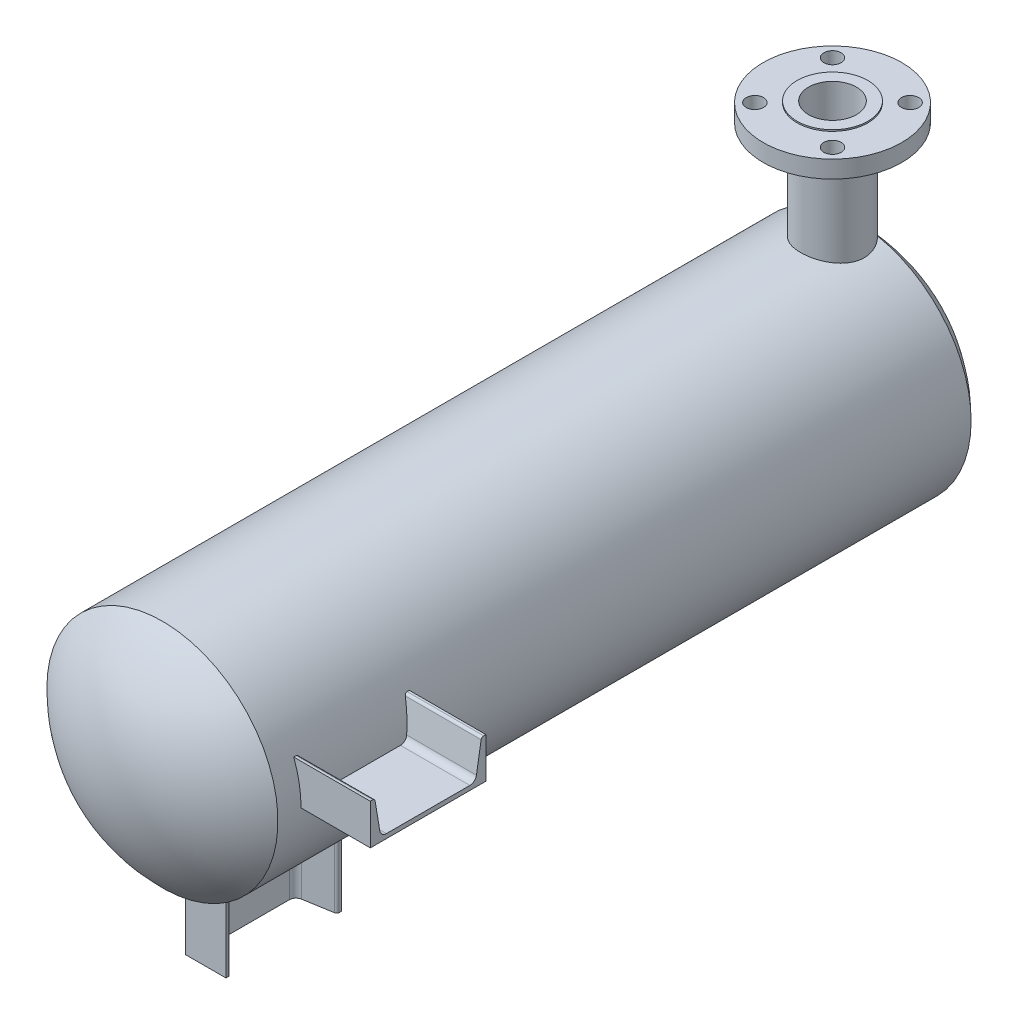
from build123d import *

# Parameters (mm, degrees)
BOSS_EXTRUDE1_DEPTH       = 203.2
CIRPATTERN1_COUNT         = 2
CIRPATTERN1_ANGLE         = 90
BOLT_HOLE_REACH           = 1228.232
BOLT_CIRCLE_SKETCH_R      = 9.525
BOLT_CIRCLE_PATTERN_COUNT = 4


with BuildPart() as part:
    # Sketch1 → Revolve1 (revolve)
    with BuildSketch(Plane(origin=(0, 0, 0), x_dir=(1, 0, 0), z_dir=(0, 1, 0))):
        with BuildLine():
            Line((-127, 381), (-127, -381))
            ThreePointArc((-127, -381), (-68.87837384, -420.482392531), (0, -434.365921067))
            Line((0, -434.365921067), (0, 434.365921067))
            ThreePointArc((0, 434.365921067), (-68.87837384, 420.482392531), (-127, 381))
        make_face()
    revolve(axis=Axis((0, 0, -434.365921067), (0, 0, 1)))

    # Sketch3 → Boss-Extrude1 (add)
    with BuildSketch(Plane(origin=(0, 41.275, -85.725), x_dir=(0, 1, 0), z_dir=(1, 0, 0))):
        with BuildLine():
            Line((-41.275, 314.325), (-41.275, 441.325))
            Line((-41.275, 441.325), (3.175, 441.325))
            Line((3.175, 441.325), (3.175, 438.86608558))
            ThreePointArc((3.175, 438.86608558), (2.512888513, 437.06012673), (0.840363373, 436.110106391))
            Line((0.840363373, 436.110106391), (-30.294048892, 430.920659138))
            ThreePointArc((-30.294048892, 430.920659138), (-34.703433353, 428.416060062), (-36.449, 423.654895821))
            Line((-36.449, 423.654895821), (-36.449, 331.995104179))
            ThreePointArc((-36.449, 331.995104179), (-34.703433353, 327.233939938), (-30.294048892, 324.729340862))
            Line((-30.294048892, 324.729340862), (0.840363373, 319.539893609))
            ThreePointArc((0.840363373, 319.539893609), (2.512888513, 318.58987327), (3.175, 316.78391442))
            Line((3.175, 316.78391442), (3.175, 314.325))
            Line((3.175, 314.325), (-41.275, 314.325))
        make_face()
    boss_extrude1 = extrude(amount=BOSS_EXTRUDE1_DEPTH)

    # CirPattern1: Boss-Extrude1 ×2 about axis
    cirpattern1_axis = Axis((0, 0, 0), (0, 0, -1))
    for i in range(1, CIRPATTERN1_COUNT):
        add(boss_extrude1.rotate(cirpattern1_axis, i * CIRPATTERN1_ANGLE / (CIRPATTERN1_COUNT - 1)))

    # Nozzle_sketch → Nozzle_Body (revolve)
    with BuildSketch(Plane(origin=(0, -342.9, 254), x_dir=(0, 0, -1), z_dir=(1, 0, 0)), mode=Mode.PRIVATE) as nozzle_body_sk:
        Polygon((583.2856, 596.9), (570.738, 596.9), (570.738, 595.3125), (533.4, 595.3125), (533.4, 576.2625), (574.6496, 576.2625), (574.6496, 342.9), (583.2856, 342.9), align=None)
    revolve(nozzle_body_sk.sketch.rotate(Axis((0, 0, -355.6), (0, 1, 0)), 180), axis=Axis((0, 0, -355.6), (0, 1, 0)))

    # Bolt_circle_sketch → Bolt_hole (cut, up to next)
    with BuildSketch(Plane(origin=(0, 252.4125, -685.8), x_dir=(-1, 0, 0), z_dir=(0, 1, 0)), mode=Mode.PRIVATE) as bolt_hole_sk1:
        with Locations((42.656216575, 372.856216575)):
            Circle(BOLT_CIRCLE_SKETCH_R)
    bolt_hole_tool1 = extrude(bolt_hole_sk1.sketch, amount=-BOLT_HOLE_REACH, mode=Mode.PRIVATE) & part.part
    bolt_hole = bolt_hole_tool1.solids().sort_by_distance((-42.656217, 252.4125, -312.943783))[0]
    add(bolt_hole, mode=Mode.SUBTRACT)

    # Bolt_Circle_Pattern: Bolt_hole ×4 about axis
    bolt_circle_pattern_axis = Axis((0, 0, -355.6), (0, 1, 0))
    for i in range(1, BOLT_CIRCLE_PATTERN_COUNT):
        add(bolt_hole.rotate(bolt_circle_pattern_axis, i * 360 / BOLT_CIRCLE_PATTERN_COUNT), mode=Mode.SUBTRACT)


solid = part.part
